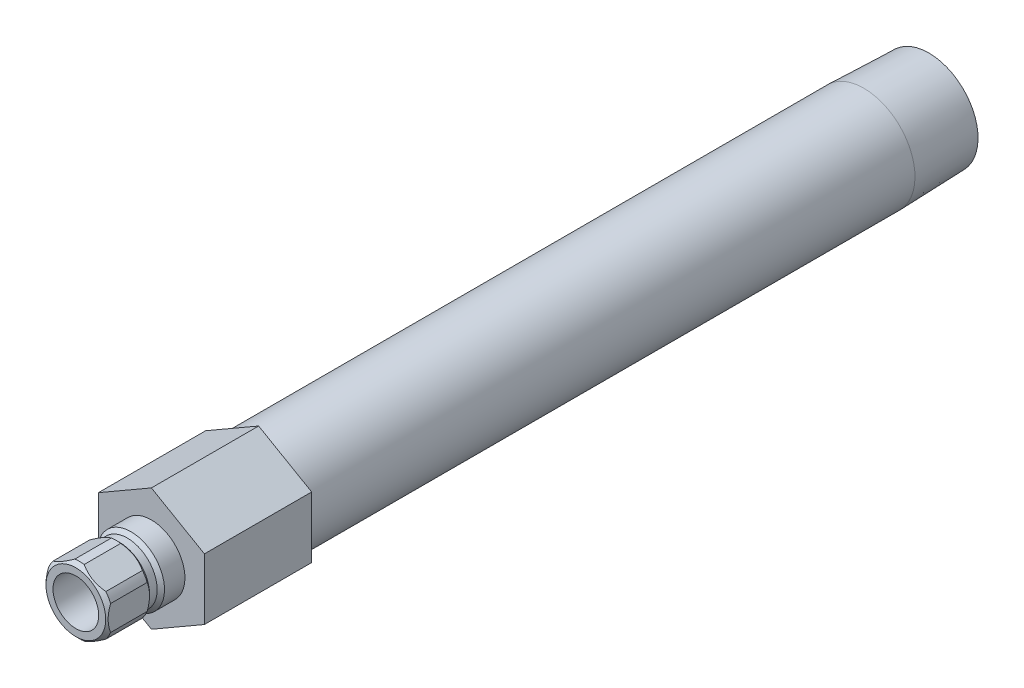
ISO-10303-21;
HEADER;
FILE_DESCRIPTION(('STEP AP214'),'2;1');
FILE_NAME('part.step','',(''),(''),'','','');
FILE_SCHEMA(('AUTOMOTIVE_DESIGN { 1 0 10303 214 1 1 1 1 }'));
ENDSEC;
DATA;
#1=APPLICATION_CONTEXT('core data for automotive mechanical design processes');
#2=APPLICATION_PROTOCOL_DEFINITION('international standard','automotive_design',2000,#1);
#3=PRODUCT_CONTEXT('',#1,'mechanical');
#4=PRODUCT('Part','Part','',(#3));
#5=PRODUCT_RELATED_PRODUCT_CATEGORY('part','',(#4));
#6=PRODUCT_DEFINITION_FORMATION('','',#4);
#7=PRODUCT_DEFINITION_CONTEXT('part definition',#1,'design');
#8=PRODUCT_DEFINITION('design','',#6,#7);
#9=PRODUCT_DEFINITION_SHAPE('','',#8);
#10=(LENGTH_UNIT() NAMED_UNIT(*) SI_UNIT(.MILLI.,.METRE.));
#11=(NAMED_UNIT(*) PLANE_ANGLE_UNIT() SI_UNIT($,.RADIAN.));
#12=(NAMED_UNIT(*) SI_UNIT($,.STERADIAN.) SOLID_ANGLE_UNIT());
#13=UNCERTAINTY_MEASURE_WITH_UNIT(LENGTH_MEASURE(1.E-05),#10,'distance_accuracy_value','');
#14=(GEOMETRIC_REPRESENTATION_CONTEXT(3) GLOBAL_UNCERTAINTY_ASSIGNED_CONTEXT((#13)) GLOBAL_UNIT_ASSIGNED_CONTEXT((#10,
#11,#12)) REPRESENTATION_CONTEXT('',''));
#15=CARTESIAN_POINT('',(0.,0.,0.));
#16=DIRECTION('',(0.,0.,1.));
#17=DIRECTION('',(1.,0.,0.));
#18=AXIS2_PLACEMENT_3D('',#15,#16,#17);
#19=CARTESIAN_POINT('',(0.,0.,13.1223734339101));
#20=DIRECTION('',(0.,0.,-1.));
#21=DIRECTION('',(0.,1.,0.));
#22=AXIS2_PLACEMENT_3D('',#19,#20,#21);
#23=CYLINDRICAL_SURFACE('',#22,6.985);
#24=DIRECTION('',(0.,0.,-1.));
#25=VECTOR('',#24,1.);
#26=CARTESIAN_POINT('',(5.50323442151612,-4.30170151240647,13.1223734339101));
#27=LINE('',#26,#25);
#28=CARTESIAN_POINT('',(5.50323442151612,-4.30170151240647,7.366));
#29=VERTEX_POINT('',#28);
#30=CARTESIAN_POINT('',(5.50323442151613,-4.30170151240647,14.986));
#31=VERTEX_POINT('',#30);
#32=EDGE_CURVE('E406',#29,#31,#27,.F.);
#33=ORIENTED_EDGE('',*,*,#32,.F.);
#34=CARTESIAN_POINT('',(0.,0.,7.366));
#35=DIRECTION('',(0.,0.,-1.));
#36=DIRECTION('',(0.,1.,0.));
#37=AXIS2_PLACEMENT_3D('',#34,#35,#36);
#38=CIRCLE('',#37,6.985);
#39=CARTESIAN_POINT('',(6.477,-2.61509005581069,7.366));
#40=VERTEX_POINT('',#39);
#41=EDGE_CURVE('E383',#40,#29,#38,.T.);
#42=ORIENTED_EDGE('',*,*,#41,.F.);
#43=DIRECTION('',(0.,0.,-1.));
#44=VECTOR('',#43,1.);
#45=CARTESIAN_POINT('',(6.477,-2.61509005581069,13.1223734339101));
#46=LINE('',#45,#44);
#47=CARTESIAN_POINT('',(6.477,-2.6150900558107,14.986));
#48=VERTEX_POINT('',#47);
#49=EDGE_CURVE('E397',#48,#40,#46,.T.);
#50=ORIENTED_EDGE('',*,*,#49,.F.);
#51=CARTESIAN_POINT('',(0.,0.,14.986));
#52=DIRECTION('',(0.,0.,-1.));
#53=DIRECTION('',(0.,1.,0.));
#54=AXIS2_PLACEMENT_3D('',#51,#52,#53);
#55=CIRCLE('',#54,6.985);
#56=EDGE_CURVE('E191',#48,#31,#55,.T.);
#57=ORIENTED_EDGE('',*,*,#56,.T.);
#58=EDGE_LOOP('',(#33,#42,#50,#57));
#59=FACE_BOUND('',#58,.T.);
#60=ADVANCED_FACE('F34',(#59),#23,.T.);
#61=DIRECTION('',(0.,0.,-1.));
#62=VECTOR('',#61,1.);
#63=CARTESIAN_POINT('',(6.477,2.6150900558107,13.1223734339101));
#64=LINE('',#63,#62);
#65=CARTESIAN_POINT('',(6.477,2.6150900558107,7.366));
#66=VERTEX_POINT('',#65);
#67=CARTESIAN_POINT('',(6.477,2.6150900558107,14.986));
#68=VERTEX_POINT('',#67);
#69=EDGE_CURVE('E309',#66,#68,#64,.F.);
#70=ORIENTED_EDGE('',*,*,#69,.F.);
#71=CARTESIAN_POINT('',(5.50323442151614,4.30170151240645,7.366));
#72=VERTEX_POINT('',#71);
#73=EDGE_CURVE('E204',#72,#66,#38,.T.);
#74=ORIENTED_EDGE('',*,*,#73,.F.);
#75=DIRECTION('',(0.,0.,-1.));
#76=VECTOR('',#75,1.);
#77=CARTESIAN_POINT('',(5.50323442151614,4.30170151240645,13.1223734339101));
#78=LINE('',#77,#76);
#79=CARTESIAN_POINT('',(5.50323442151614,4.30170151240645,14.986));
#80=VERTEX_POINT('',#79);
#81=EDGE_CURVE('E394',#80,#72,#78,.T.);
#82=ORIENTED_EDGE('',*,*,#81,.F.);
#83=EDGE_CURVE('E198',#80,#68,#55,.T.);
#84=ORIENTED_EDGE('',*,*,#83,.T.);
#85=EDGE_LOOP('',(#70,#74,#82,#84));
#86=FACE_BOUND('',#85,.T.);
#87=ADVANCED_FACE('F343',(#86),#23,.T.);
#88=DIRECTION('',(0.,0.,-1.));
#89=VECTOR('',#88,1.);
#90=CARTESIAN_POINT('',(0.973765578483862,6.91679156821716,13.1223734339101));
#91=LINE('',#90,#89);
#92=CARTESIAN_POINT('',(0.973765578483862,6.91679156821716,7.366));
#93=VERTEX_POINT('',#92);
#94=CARTESIAN_POINT('',(0.973765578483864,6.91679156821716,14.986));
#95=VERTEX_POINT('',#94);
#96=EDGE_CURVE('E399',#93,#95,#91,.F.);
#97=ORIENTED_EDGE('',*,*,#96,.F.);
#98=CARTESIAN_POINT('',(-0.973765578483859,6.91679156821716,7.366));
#99=VERTEX_POINT('',#98);
#100=EDGE_CURVE('E200',#99,#93,#38,.T.);
#101=ORIENTED_EDGE('',*,*,#100,.F.);
#102=DIRECTION('',(0.,0.,-1.));
#103=VECTOR('',#102,1.);
#104=CARTESIAN_POINT('',(-0.973765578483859,6.91679156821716,13.1223734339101));
#105=LINE('',#104,#103);
#106=CARTESIAN_POINT('',(-0.973765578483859,6.91679156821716,14.986));
#107=VERTEX_POINT('',#106);
#108=EDGE_CURVE('E375',#107,#99,#105,.T.);
#109=ORIENTED_EDGE('',*,*,#108,.F.);
#110=EDGE_CURVE('E193',#107,#95,#55,.T.);
#111=ORIENTED_EDGE('',*,*,#110,.T.);
#112=EDGE_LOOP('',(#97,#101,#109,#111));
#113=FACE_BOUND('',#112,.T.);
#114=ADVANCED_FACE('F348',(#113),#23,.T.);
#115=DIRECTION('',(0.,0.,-1.));
#116=VECTOR('',#115,1.);
#117=CARTESIAN_POINT('',(-5.50323442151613,4.30170151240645,13.1223734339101));
#118=LINE('',#117,#116);
#119=CARTESIAN_POINT('',(-5.50323442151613,4.30170151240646,7.366));
#120=VERTEX_POINT('',#119);
#121=CARTESIAN_POINT('',(-5.50323442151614,4.30170151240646,14.986));
#122=VERTEX_POINT('',#121);
#123=EDGE_CURVE('E54',#120,#122,#118,.F.);
#124=ORIENTED_EDGE('',*,*,#123,.F.);
#125=CARTESIAN_POINT('',(-6.477,2.6150900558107,7.366));
#126=VERTEX_POINT('',#125);
#127=EDGE_CURVE('E203',#126,#120,#38,.T.);
#128=ORIENTED_EDGE('',*,*,#127,.F.);
#129=DIRECTION('',(0.,0.,-1.));
#130=VECTOR('',#129,1.);
#131=CARTESIAN_POINT('',(-6.477,2.6150900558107,13.1223734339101));
#132=LINE('',#131,#130);
#133=CARTESIAN_POINT('',(-6.477,2.61509005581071,14.986));
#134=VERTEX_POINT('',#133);
#135=EDGE_CURVE('E263',#134,#126,#132,.T.);
#136=ORIENTED_EDGE('',*,*,#135,.F.);
#137=EDGE_CURVE('E189',#134,#122,#55,.T.);
#138=ORIENTED_EDGE('',*,*,#137,.T.);
#139=EDGE_LOOP('',(#124,#128,#136,#138));
#140=FACE_BOUND('',#139,.T.);
#141=ADVANCED_FACE('F360',(#140),#23,.T.);
#142=DIRECTION('',(0.,0.,-1.));
#143=VECTOR('',#142,1.);
#144=CARTESIAN_POINT('',(-6.477,-2.6150900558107,13.1223734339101));
#145=LINE('',#144,#143);
#146=CARTESIAN_POINT('',(-6.477,-2.61509005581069,7.366));
#147=VERTEX_POINT('',#146);
#148=CARTESIAN_POINT('',(-6.477,-2.6150900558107,14.986));
#149=VERTEX_POINT('',#148);
#150=EDGE_CURVE('E62',#147,#149,#145,.F.);
#151=ORIENTED_EDGE('',*,*,#150,.F.);
#152=CARTESIAN_POINT('',(-5.50323442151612,-4.30170151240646,7.366));
#153=VERTEX_POINT('',#152);
#154=EDGE_CURVE('E182',#153,#147,#38,.T.);
#155=ORIENTED_EDGE('',*,*,#154,.F.);
#156=DIRECTION('',(0.,0.,-1.));
#157=VECTOR('',#156,1.);
#158=CARTESIAN_POINT('',(-5.50323442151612,-4.30170151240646,13.1223734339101));
#159=LINE('',#158,#157);
#160=CARTESIAN_POINT('',(-5.50323442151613,-4.30170151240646,14.986));
#161=VERTEX_POINT('',#160);
#162=EDGE_CURVE('E165',#161,#153,#159,.T.);
#163=ORIENTED_EDGE('',*,*,#162,.F.);
#164=EDGE_CURVE('E180',#161,#149,#55,.T.);
#165=ORIENTED_EDGE('',*,*,#164,.T.);
#166=EDGE_LOOP('',(#151,#155,#163,#165));
#167=FACE_BOUND('',#166,.T.);
#168=ADVANCED_FACE('F179',(#167),#23,.T.);
#169=CARTESIAN_POINT('',(0.,0.,13.1223734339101));
#170=DIRECTION('',(0.,0.,-1.));
#171=DIRECTION('',(0.,1.,0.));
#172=AXIS2_PLACEMENT_3D('',#169,#170,#171);
#173=CYLINDRICAL_SURFACE('',#172,10.668);
#174=CARTESIAN_POINT('',(0.,0.,-148.4884));
#175=DIRECTION('',(0.,0.,-1.));
#176=DIRECTION('',(0.,1.,0.));
#177=AXIS2_PLACEMENT_3D('',#174,#175,#176);
#178=CIRCLE('',#177,10.6679999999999);
#179=CARTESIAN_POINT('',(0.,10.668,-148.4884));
#180=VERTEX_POINT('',#179);
#181=EDGE_CURVE('E217',#180,#180,#178,.T.);
#182=ORIENTED_EDGE('',*,*,#181,.F.);
#183=EDGE_LOOP('',(#182));
#184=FACE_BOUND('',#183,.T.);
#185=CARTESIAN_POINT('',(0.,0.,-22.352));
#186=DIRECTION('',(0.,0.,1.));
#187=DIRECTION('',(1.,0.,0.));
#188=AXIS2_PLACEMENT_3D('',#185,#186,#187);
#189=CIRCLE('',#188,10.668);
#190=CARTESIAN_POINT('',(10.668,0.,-22.352));
#191=VERTEX_POINT('',#190);
#192=EDGE_CURVE('E231',#191,#191,#189,.F.);
#193=ORIENTED_EDGE('',*,*,#192,.T.);
#194=EDGE_LOOP('',(#193));
#195=FACE_BOUND('',#194,.T.);
#196=ADVANCED_FACE('F359',(#184,#195),#173,.T.);
#197=CARTESIAN_POINT('',(0.,0.,13.1223734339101));
#198=DIRECTION('',(0.,0.,-1.));
#199=DIRECTION('',(0.,1.,0.));
#200=AXIS2_PLACEMENT_3D('',#197,#198,#199);
#201=CYLINDRICAL_SURFACE('',#200,4.76249999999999);
#202=CARTESIAN_POINT('',(0.,0.,15.748));
#203=DIRECTION('',(0.,0.,-1.));
#204=DIRECTION('',(0.,1.,0.));
#205=AXIS2_PLACEMENT_3D('',#202,#203,#204);
#206=CIRCLE('',#205,4.7625);
#207=CARTESIAN_POINT('',(0.,4.7625,15.748));
#208=VERTEX_POINT('',#207);
#209=EDGE_CURVE('E233',#208,#208,#206,.T.);
#210=ORIENTED_EDGE('',*,*,#209,.F.);
#211=EDGE_LOOP('',(#210));
#212=FACE_BOUND('',#211,.T.);
#213=CARTESIAN_POINT('',(0.,0.,-22.352));
#214=DIRECTION('',(0.,0.,-1.));
#215=DIRECTION('',(0.,1.,0.));
#216=AXIS2_PLACEMENT_3D('',#213,#214,#215);
#217=CIRCLE('',#216,4.76249999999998);
#218=CARTESIAN_POINT('',(0.,4.7625,-22.352));
#219=VERTEX_POINT('',#218);
#220=EDGE_CURVE('E174',#219,#219,#217,.T.);
#221=ORIENTED_EDGE('',*,*,#220,.T.);
#222=EDGE_LOOP('',(#221));
#223=FACE_BOUND('',#222,.T.);
#224=ADVANCED_FACE('F36',(#212,#223),#201,.F.);
#225=CARTESIAN_POINT('',(0.,4.7625,-22.352));
#226=DIRECTION('',(0.,0.,-1.));
#227=DIRECTION('',(0.,1.,0.));
#228=AXIS2_PLACEMENT_3D('',#225,#226,#227);
#229=PLANE('',#228);
#230=CARTESIAN_POINT('',(0.,0.,-22.352));
#231=DIRECTION('',(0.,0.,-1.));
#232=DIRECTION('',(0.,1.,0.));
#233=AXIS2_PLACEMENT_3D('',#230,#231,#232);
#234=CIRCLE('',#233,7.89939999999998);
#235=CARTESIAN_POINT('',(0.,7.8994,-22.352));
#236=VERTEX_POINT('',#235);
#237=EDGE_CURVE('E226',#236,#236,#234,.T.);
#238=ORIENTED_EDGE('',*,*,#237,.T.);
#239=EDGE_LOOP('',(#238));
#240=FACE_BOUND('',#239,.T.);
#241=ORIENTED_EDGE('',*,*,#220,.F.);
#242=EDGE_LOOP('',(#241));
#243=FACE_BOUND('',#242,.T.);
#244=ADVANCED_FACE('F533',(#240,#243),#229,.T.);
#245=CARTESIAN_POINT('',(0.,0.,13.1223734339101));
#246=DIRECTION('',(0.,0.,-1.));
#247=DIRECTION('',(0.,1.,0.));
#248=AXIS2_PLACEMENT_3D('',#245,#246,#247);
#249=CYLINDRICAL_SURFACE('',#248,7.89939999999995);
#250=CARTESIAN_POINT('',(0.,0.,-162.052));
#251=DIRECTION('',(0.,0.,-1.));
#252=DIRECTION('',(0.,1.,0.));
#253=AXIS2_PLACEMENT_3D('',#250,#251,#252);
#254=CIRCLE('',#253,7.89939999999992);
#255=CARTESIAN_POINT('',(0.,7.8994,-162.052));
#256=VERTEX_POINT('',#255);
#257=EDGE_CURVE('E223',#256,#256,#254,.T.);
#258=ORIENTED_EDGE('',*,*,#257,.T.);
#259=EDGE_LOOP('',(#258));
#260=FACE_BOUND('',#259,.T.);
#261=ORIENTED_EDGE('',*,*,#237,.F.);
#262=EDGE_LOOP('',(#261));
#263=FACE_BOUND('',#262,.T.);
#264=ADVANCED_FACE('F530',(#260,#263),#249,.F.);
#265=CARTESIAN_POINT('',(0.,10.244140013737,-162.052));
#266=DIRECTION('',(0.,0.,-1.));
#267=DIRECTION('',(0.,1.,0.));
#268=AXIS2_PLACEMENT_3D('',#265,#266,#267);
#269=PLANE('',#268);
#270=CARTESIAN_POINT('',(0.,0.,-162.052));
#271=DIRECTION('',(0.,0.,-1.));
#272=DIRECTION('',(0.,1.,0.));
#273=AXIS2_PLACEMENT_3D('',#270,#271,#272);
#274=CIRCLE('',#273,10.2441400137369);
#275=CARTESIAN_POINT('',(0.,10.244140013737,-162.052));
#276=VERTEX_POINT('',#275);
#277=EDGE_CURVE('E220',#276,#276,#274,.T.);
#278=ORIENTED_EDGE('',*,*,#277,.T.);
#279=EDGE_LOOP('',(#278));
#280=FACE_BOUND('',#279,.T.);
#281=ORIENTED_EDGE('',*,*,#257,.F.);
#282=EDGE_LOOP('',(#281));
#283=FACE_BOUND('',#282,.T.);
#284=ADVANCED_FACE('F524',(#280,#283),#269,.T.);
#285=CARTESIAN_POINT('',(0.,0.,-162.052));
#286=DIRECTION('',(0.,0.,1.));
#287=DIRECTION('',(0.,-1.,0.));
#288=AXIS2_PLACEMENT_3D('',#285,#286,#287);
#289=CONICAL_SURFACE('',#288,10.2441400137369,0.0312396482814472);
#290=ORIENTED_EDGE('',*,*,#181,.T.);
#291=EDGE_LOOP('',(#290));
#292=FACE_BOUND('',#291,.T.);
#293=ORIENTED_EDGE('',*,*,#277,.F.);
#294=EDGE_LOOP('',(#293));
#295=FACE_BOUND('',#294,.T.);
#296=ADVANCED_FACE('F514',(#292,#295),#289,.T.);
#297=CARTESIAN_POINT('',(0.,6.985,0.));
#298=DIRECTION('',(0.,0.,1.));
#299=DIRECTION('',(0.,-1.,0.));
#300=AXIS2_PLACEMENT_3D('',#297,#298,#299);
#301=PLANE('',#300);
#302=CARTESIAN_POINT('',(0.,0.,0.));
#303=DIRECTION('',(0.,0.,-1.));
#304=DIRECTION('',(0.,1.,0.));
#305=AXIS2_PLACEMENT_3D('',#302,#303,#304);
#306=CIRCLE('',#305,6.98499999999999);
#307=CARTESIAN_POINT('',(0.,6.985,0.));
#308=VERTEX_POINT('',#307);
#309=EDGE_CURVE('E214',#308,#308,#306,.T.);
#310=ORIENTED_EDGE('',*,*,#309,.T.);
#311=EDGE_LOOP('',(#310));
#312=FACE_BOUND('',#311,.T.);
#313=DIRECTION('',(-0.866025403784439,-0.5,0.));
#314=VECTOR('',#313,1.);
#315=CARTESIAN_POINT('',(0.,12.7582862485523,0.));
#316=LINE('',#315,#314);
#317=CARTESIAN_POINT('',(0.,12.7582862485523,0.));
#318=VERTEX_POINT('',#317);
#319=CARTESIAN_POINT('',(-11.049,6.37914312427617,0.));
#320=VERTEX_POINT('',#319);
#321=EDGE_CURVE('E409',#318,#320,#316,.T.);
#322=ORIENTED_EDGE('',*,*,#321,.T.);
#323=DIRECTION('',(0.,-1.,0.));
#324=VECTOR('',#323,1.);
#325=CARTESIAN_POINT('',(-11.049,6.37914312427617,0.));
#326=LINE('',#325,#324);
#327=CARTESIAN_POINT('',(-11.049,-6.37914312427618,0.));
#328=VERTEX_POINT('',#327);
#329=EDGE_CURVE('E436',#320,#328,#326,.T.);
#330=ORIENTED_EDGE('',*,*,#329,.T.);
#331=DIRECTION('',(0.866025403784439,-0.5,0.));
#332=VECTOR('',#331,1.);
#333=CARTESIAN_POINT('',(-11.049,-6.37914312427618,0.));
#334=LINE('',#333,#332);
#335=CARTESIAN_POINT('',(0.,-12.7582862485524,0.));
#336=VERTEX_POINT('',#335);
#337=EDGE_CURVE('E439',#328,#336,#334,.T.);
#338=ORIENTED_EDGE('',*,*,#337,.T.);
#339=DIRECTION('',(0.866025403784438,0.5,0.));
#340=VECTOR('',#339,1.);
#341=CARTESIAN_POINT('',(0.,-12.7582862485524,0.));
#342=LINE('',#341,#340);
#343=CARTESIAN_POINT('',(11.049,-6.37914312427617,0.));
#344=VERTEX_POINT('',#343);
#345=EDGE_CURVE('E442',#336,#344,#342,.T.);
#346=ORIENTED_EDGE('',*,*,#345,.T.);
#347=DIRECTION('',(0.,1.,0.));
#348=VECTOR('',#347,1.);
#349=CARTESIAN_POINT('',(11.049,-6.37914312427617,0.));
#350=LINE('',#349,#348);
#351=CARTESIAN_POINT('',(11.049,6.37914312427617,0.));
#352=VERTEX_POINT('',#351);
#353=EDGE_CURVE('E445',#344,#352,#350,.T.);
#354=ORIENTED_EDGE('',*,*,#353,.T.);
#355=DIRECTION('',(-0.866025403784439,0.5,0.));
#356=VECTOR('',#355,1.);
#357=CARTESIAN_POINT('',(11.049,6.37914312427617,0.));
#358=LINE('',#357,#356);
#359=EDGE_CURVE('E418',#352,#318,#358,.T.);
#360=ORIENTED_EDGE('',*,*,#359,.T.);
#361=EDGE_LOOP('',(#322,#330,#338,#346,#354,#360));
#362=FACE_BOUND('',#361,.T.);
#363=ADVANCED_FACE('F511',(#312,#362),#301,.T.);
#364=CARTESIAN_POINT('',(0.,0.,13.1223734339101));
#365=DIRECTION('',(0.,0.,-1.));
#366=DIRECTION('',(0.,1.,0.));
#367=AXIS2_PLACEMENT_3D('',#364,#365,#366);
#368=CYLINDRICAL_SURFACE('',#367,6.98499999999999);
#369=CARTESIAN_POINT('',(0.,0.,4.25449999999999));
#370=DIRECTION('',(0.,0.,-1.));
#371=DIRECTION('',(0.,1.,0.));
#372=AXIS2_PLACEMENT_3D('',#369,#370,#371);
#373=CIRCLE('',#372,6.98499999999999);
#374=CARTESIAN_POINT('',(0.,6.985,4.2545));
#375=VERTEX_POINT('',#374);
#376=EDGE_CURVE('E211',#375,#375,#373,.T.);
#377=ORIENTED_EDGE('',*,*,#376,.T.);
#378=EDGE_LOOP('',(#377));
#379=FACE_BOUND('',#378,.T.);
#380=ORIENTED_EDGE('',*,*,#309,.F.);
#381=EDGE_LOOP('',(#380));
#382=FACE_BOUND('',#381,.T.);
#383=ADVANCED_FACE('F513',(#379,#382),#368,.T.);
#384=CARTESIAN_POINT('',(0.,0.,4.25449999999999));
#385=DIRECTION('',(0.,0.,-1.));
#386=DIRECTION('',(0.,1.,0.));
#387=AXIS2_PLACEMENT_3D('',#384,#385,#386);
#388=CONICAL_SURFACE('',#387,6.98499999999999,0.785398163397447);
#389=CARTESIAN_POINT('',(0.,0.,5.0165));
#390=DIRECTION('',(0.,0.,-1.));
#391=DIRECTION('',(0.,1.,0.));
#392=AXIS2_PLACEMENT_3D('',#389,#390,#391);
#393=CIRCLE('',#392,6.223);
#394=CARTESIAN_POINT('',(0.,6.223,5.0165));
#395=VERTEX_POINT('',#394);
#396=EDGE_CURVE('E208',#395,#395,#393,.T.);
#397=ORIENTED_EDGE('',*,*,#396,.T.);
#398=EDGE_LOOP('',(#397));
#399=FACE_BOUND('',#398,.T.);
#400=ORIENTED_EDGE('',*,*,#376,.F.);
#401=EDGE_LOOP('',(#400));
#402=FACE_BOUND('',#401,.T.);
#403=ADVANCED_FACE('F521',(#399,#402),#388,.T.);
#404=CARTESIAN_POINT('',(0.,0.,13.1223734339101));
#405=DIRECTION('',(0.,0.,-1.));
#406=DIRECTION('',(0.,1.,0.));
#407=AXIS2_PLACEMENT_3D('',#404,#405,#406);
#408=CYLINDRICAL_SURFACE('',#407,6.223);
#409=CARTESIAN_POINT('',(0.,0.,6.604));
#410=DIRECTION('',(0.,0.,-1.));
#411=DIRECTION('',(0.,1.,0.));
#412=AXIS2_PLACEMENT_3D('',#409,#410,#411);
#413=CIRCLE('',#412,6.223);
#414=CARTESIAN_POINT('',(0.,6.223,6.604));
#415=VERTEX_POINT('',#414);
#416=EDGE_CURVE('E205',#415,#415,#413,.T.);
#417=ORIENTED_EDGE('',*,*,#416,.T.);
#418=EDGE_LOOP('',(#417));
#419=FACE_BOUND('',#418,.T.);
#420=ORIENTED_EDGE('',*,*,#396,.F.);
#421=EDGE_LOOP('',(#420));
#422=FACE_BOUND('',#421,.T.);
#423=ADVANCED_FACE('F270',(#419,#422),#408,.T.);
#424=CARTESIAN_POINT('',(0.,0.,6.604));
#425=DIRECTION('',(0.,0.,1.));
#426=DIRECTION('',(0.,-1.,0.));
#427=AXIS2_PLACEMENT_3D('',#424,#425,#426);
#428=CONICAL_SURFACE('',#427,6.223,0.785398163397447);
#429=CARTESIAN_POINT('',(0.97330298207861,-6.91705864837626,7.3662));
#430=CARTESIAN_POINT('',(1.15430521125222,-6.81255696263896,7.28788330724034));
#431=CARTESIAN_POINT('',(1.33782092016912,-6.70660411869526,7.21664558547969));
#432=CARTESIAN_POINT('',(1.70963160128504,-6.49193912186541,7.09114753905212));
#433=CARTESIAN_POINT('',(1.89793754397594,-6.38322063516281,7.03693086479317));
#434=CARTESIAN_POINT('',(2.27146153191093,-6.16756646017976,6.95027563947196));
#435=CARTESIAN_POINT('',(2.45655498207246,-6.06070270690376,6.91713772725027));
#436=CARTESIAN_POINT('',(2.82844640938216,-5.8459910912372,6.87178043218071));
#437=CARTESIAN_POINT('',(3.01524193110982,-5.73814464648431,6.85953461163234));
#438=CARTESIAN_POINT('',(3.39480578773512,-5.51900335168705,6.85669437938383));
#439=CARTESIAN_POINT('',(3.58757842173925,-5.40770601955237,6.86678827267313));
#440=CARTESIAN_POINT('',(3.97148128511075,-5.18605959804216,6.9093291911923));
#441=CARTESIAN_POINT('',(4.16260891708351,-5.07571200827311,6.9418066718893));
#442=CARTESIAN_POINT('',(4.54854122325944,-4.85289388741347,7.02857263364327));
#443=CARTESIAN_POINT('',(4.74321398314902,-4.74049951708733,7.08363522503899));
#444=CARTESIAN_POINT('',(5.03141021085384,-4.57410934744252,7.17999209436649));
#445=CARTESIAN_POINT('',(5.12673323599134,-4.51907457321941,7.21435772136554));
#446=CARTESIAN_POINT('',(5.31613879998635,-4.40972121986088,7.28725547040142));
#447=CARTESIAN_POINT('',(5.41022179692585,-4.3554023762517,7.32578600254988));
#448=CARTESIAN_POINT('',(5.50369701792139,-4.30143443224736,7.3662));
#449=B_SPLINE_CURVE_WITH_KNOTS('',3,(#429,#430,#431,#432,#433,#434,#435,#436,#437,#438,#439,
#440,#441,#442,#443,#444,#445,#446,#447,#448),.UNSPECIFIED.,.F.,.F.,(4,2,2,2,2,2,2,2,2,4),(0.,
0.669810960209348,1.34132587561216,1.9892054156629,2.63626449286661,3.30353665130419,
3.97171850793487,4.66502165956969,5.01088265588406,5.35661208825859),.UNSPECIFIED.);
#450=CARTESIAN_POINT('',(0.973765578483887,-6.91679156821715,7.366));
#451=VERTEX_POINT('',#450);
#452=EDGE_CURVE('E408',#451,#29,#449,.T.);
#453=ORIENTED_EDGE('',*,*,#452,.F.);
#454=CARTESIAN_POINT('',(-0.97376557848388,-6.91679156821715,7.366));
#455=VERTEX_POINT('',#454);
#456=EDGE_CURVE('E381',#451,#455,#38,.T.);
#457=ORIENTED_EDGE('',*,*,#456,.T.);
#458=CARTESIAN_POINT('',(-5.50369701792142,-4.30143443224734,7.36620000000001));
#459=CARTESIAN_POINT('',(-5.32269478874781,-4.40593611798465,7.28788330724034));
#460=CARTESIAN_POINT('',(-5.13917907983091,-4.51188896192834,7.2166455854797));
#461=CARTESIAN_POINT('',(-4.76736839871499,-4.7265539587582,7.09114753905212));
#462=CARTESIAN_POINT('',(-4.57906245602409,-4.83527244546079,7.03693086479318));
#463=CARTESIAN_POINT('',(-4.20553846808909,-5.05092662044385,6.95027563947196));
#464=CARTESIAN_POINT('',(-4.02044501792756,-5.15779037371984,6.91713772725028));
#465=CARTESIAN_POINT('',(-3.64855359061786,-5.37250198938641,6.87178043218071));
#466=CARTESIAN_POINT('',(-3.4617580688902,-5.48034843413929,6.85953461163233));
#467=CARTESIAN_POINT('',(-3.0821942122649,-5.69948972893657,6.85669437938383));
#468=CARTESIAN_POINT('',(-2.88942157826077,-5.81078706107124,6.86678827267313));
#469=CARTESIAN_POINT('',(-2.50551871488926,-6.03243348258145,6.90932919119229));
#470=CARTESIAN_POINT('',(-2.3143910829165,-6.1427810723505,6.9418066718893));
#471=CARTESIAN_POINT('',(-1.92845877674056,-6.36559919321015,7.02857263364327));
#472=CARTESIAN_POINT('',(-1.73378601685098,-6.47799356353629,7.08363522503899));
#473=CARTESIAN_POINT('',(-1.44558978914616,-6.6443837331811,7.17999209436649));
#474=CARTESIAN_POINT('',(-1.35026676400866,-6.69941850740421,7.21435772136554));
#475=CARTESIAN_POINT('',(-1.16086120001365,-6.80877186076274,7.28725547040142));
#476=CARTESIAN_POINT('',(-1.06677820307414,-6.86309070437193,7.32578600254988));
#477=CARTESIAN_POINT('',(-0.973302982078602,-6.91705864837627,7.3662));
#478=B_SPLINE_CURVE_WITH_KNOTS('',3,(#458,#459,#460,#461,#462,#463,#464,#465,#466,#467,#468,
#469,#470,#471,#472,#473,#474,#475,#476,#477),.UNSPECIFIED.,.F.,.F.,(4,2,2,2,2,2,2,2,2,4),(0.,
0.669810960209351,1.34132587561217,1.98920541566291,2.63626449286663,3.30353665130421,
3.97171850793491,4.66502165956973,5.0108826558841,5.35661208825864),.UNSPECIFIED.);
#479=EDGE_CURVE('E256',#153,#455,#478,.T.);
#480=ORIENTED_EDGE('',*,*,#479,.F.);
#481=ORIENTED_EDGE('',*,*,#154,.T.);
#482=CARTESIAN_POINT('',(-6.477,-7.50531717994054,10.2946933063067));
#483=CARTESIAN_POINT('',(-6.477,-7.32278230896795,10.1565337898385));
#484=CARTESIAN_POINT('',(-6.477,-7.13923073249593,10.0196957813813));
#485=CARTESIAN_POINT('',(-6.477,-6.76969107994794,9.74925615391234));
#486=CARTESIAN_POINT('',(-6.477,-6.58370240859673,9.61565534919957));
#487=CARTESIAN_POINT('',(-6.477,-6.20752484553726,9.35133325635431));
#488=CARTESIAN_POINT('',(-6.477,-6.01731457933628,9.22064228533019));
#489=CARTESIAN_POINT('',(-6.477,-5.63367369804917,8.96409124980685));
#490=CARTESIAN_POINT('',(-6.477,-5.44024331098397,8.83823084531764));
#491=CARTESIAN_POINT('',(-6.477,-5.03831720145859,8.58528971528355));
#492=CARTESIAN_POINT('',(-6.477,-4.8295984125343,8.45856164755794));
#493=CARTESIAN_POINT('',(-6.477,-4.4072839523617,8.21337587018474));
#494=CARTESIAN_POINT('',(-6.477,-4.19368750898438,8.09491948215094));
#495=CARTESIAN_POINT('',(-6.477,-3.7616267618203,7.8688284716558));
#496=CARTESIAN_POINT('',(-6.477,-3.54317924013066,7.76116202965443));
#497=CARTESIAN_POINT('',(-6.477,-3.100295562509,7.55906153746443));
#498=CARTESIAN_POINT('',(-6.477,-2.87586219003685,7.46462146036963));
#499=CARTESIAN_POINT('',(-6.477,-2.43955826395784,7.2995033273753));
#500=CARTESIAN_POINT('',(-6.477,-2.22819339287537,7.2275028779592));
#501=CARTESIAN_POINT('',(-6.477,-1.80033354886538,7.10045249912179));
#502=CARTESIAN_POINT('',(-6.477,-1.58383822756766,7.0454037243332));
#503=CARTESIAN_POINT('',(-6.477,-1.15063390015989,6.95606140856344));
#504=CARTESIAN_POINT('',(-6.477,-0.934000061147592,6.92140936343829));
#505=CARTESIAN_POINT('',(-6.477,-0.498364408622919,6.87354056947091));
#506=CARTESIAN_POINT('',(-6.477,-0.279363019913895,6.86032003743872));
#507=CARTESIAN_POINT('',(-6.477,0.150697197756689,6.85631642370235));
#508=CARTESIAN_POINT('',(-6.477,0.361748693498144,6.8647176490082));
#509=CARTESIAN_POINT('',(-6.477,0.782066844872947,6.90168275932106));
#510=CARTESIAN_POINT('',(-6.477,0.991333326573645,6.93024858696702));
#511=CARTESIAN_POINT('',(-6.477,1.41010575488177,7.00646246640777));
#512=CARTESIAN_POINT('',(-6.477,1.61955133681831,7.05443689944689));
#513=CARTESIAN_POINT('',(-6.477,2.03387291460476,7.16689535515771));
#514=CARTESIAN_POINT('',(-6.477,2.23874927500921,7.2313780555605));
#515=CARTESIAN_POINT('',(-6.477,2.66141718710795,7.38044013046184));
#516=CARTESIAN_POINT('',(-6.477,2.87875617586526,7.46628961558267));
#517=CARTESIAN_POINT('',(-6.477,3.30779766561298,7.65118196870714));
#518=CARTESIAN_POINT('',(-6.477,3.51949749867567,7.75023095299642));
#519=CARTESIAN_POINT('',(-6.477,3.93828980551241,7.95916705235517));
#520=CARTESIAN_POINT('',(-6.477,4.14536521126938,8.06908810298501));
#521=CARTESIAN_POINT('',(-6.477,4.5547539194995,8.2973403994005));
#522=CARTESIAN_POINT('',(-6.477,4.75706796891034,8.41567031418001));
#523=CARTESIAN_POINT('',(-6.477,5.1476137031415,8.65303908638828));
#524=CARTESIAN_POINT('',(-6.477,5.33604552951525,8.77175038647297));
#525=CARTESIAN_POINT('',(-6.477,5.70967381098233,9.01417488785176));
#526=CARTESIAN_POINT('',(-6.477,5.89487001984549,9.13788846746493));
#527=CARTESIAN_POINT('',(-6.477,6.26095063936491,9.38840412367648));
#528=CARTESIAN_POINT('',(-6.477,6.44185783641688,9.51517302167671));
#529=CARTESIAN_POINT('',(-6.477,6.80119835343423,9.77207065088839));
#530=CARTESIAN_POINT('',(-6.477,6.97963234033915,9.90219844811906));
#531=CARTESIAN_POINT('',(-6.477,7.1570303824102,10.0336997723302));
#532=B_SPLINE_CURVE_WITH_KNOTS('',3,(#482,#483,#484,#485,#486,#487,#488,#489,#490,#491,#492,
#493,#494,#495,#496,#497,#498,#499,#500,#501,#502,#503,#504,#505,#506,#507,#508,#509,#510,#511,
#512,#513,#514,#515,#516,#517,#518,#519,#520,#521,#522,#523,#524,#525,#526,#527,#528,#529,#530,
#531),.UNSPECIFIED.,.F.,.F.,(4,2,2,2,2,2,2,2,2,2,2,2,2,2,2,2,2,2,2,2,2,2,2,2,4),(0.,
0.686790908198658,1.37375281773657,2.06603541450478,2.75826919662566,3.49065471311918,
4.22315698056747,4.95343127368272,5.68337170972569,6.35265989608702,7.02199365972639,
7.67918147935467,8.33625327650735,8.96890298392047,9.60161364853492,10.2454384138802,
10.8892116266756,11.5897073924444,12.2905288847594,12.9936114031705,13.6965828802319,
14.3646145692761,15.0326968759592,15.6953618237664,16.3578444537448),.UNSPECIFIED.);
#533=EDGE_CURVE('E279',#126,#147,#532,.F.);
#534=ORIENTED_EDGE('',*,*,#533,.F.);
#535=ORIENTED_EDGE('',*,*,#127,.T.);
#536=CARTESIAN_POINT('',(-0.97330298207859,6.91705864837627,7.3662));
#537=CARTESIAN_POINT('',(-1.1543052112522,6.81255696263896,7.28788330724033));
#538=CARTESIAN_POINT('',(-1.3378209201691,6.70660411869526,7.21664558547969));
#539=CARTESIAN_POINT('',(-1.70963160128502,6.49193912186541,7.09114753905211));
#540=CARTESIAN_POINT('',(-1.89793754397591,6.38322063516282,7.03693086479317));
#541=CARTESIAN_POINT('',(-2.27146153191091,6.16756646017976,6.95027563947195));
#542=CARTESIAN_POINT('',(-2.45655498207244,6.06070270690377,6.91713772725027));
#543=CARTESIAN_POINT('',(-2.82844640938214,5.8459910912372,6.87178043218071));
#544=CARTESIAN_POINT('',(-3.0152419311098,5.73814464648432,6.85953461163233));
#545=CARTESIAN_POINT('',(-3.3948057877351,5.51900335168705,6.85669437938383));
#546=CARTESIAN_POINT('',(-3.58757842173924,5.40770601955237,6.86678827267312));
#547=CARTESIAN_POINT('',(-3.97148128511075,5.18605959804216,6.90932919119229));
#548=CARTESIAN_POINT('',(-4.16260891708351,5.07571200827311,6.94180667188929));
#549=CARTESIAN_POINT('',(-4.54854122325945,4.85289388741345,7.02857263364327));
#550=CARTESIAN_POINT('',(-4.74321398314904,4.74049951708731,7.08363522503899));
#551=CARTESIAN_POINT('',(-5.03141021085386,4.5741093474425,7.17999209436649));
#552=CARTESIAN_POINT('',(-5.12673323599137,4.51907457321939,7.21435772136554));
#553=CARTESIAN_POINT('',(-5.31613879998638,4.40972121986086,7.28725547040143));
#554=CARTESIAN_POINT('',(-5.41022179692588,4.35540237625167,7.32578600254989));
#555=CARTESIAN_POINT('',(-5.50369701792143,4.30143443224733,7.36620000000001));
#556=B_SPLINE_CURVE_WITH_KNOTS('',3,(#536,#537,#538,#539,#540,#541,#542,#543,#544,#545,#546,
#547,#548,#549,#550,#551,#552,#553,#554,#555),.UNSPECIFIED.,.F.,.F.,(4,2,2,2,2,2,2,2,2,4),(0.,
0.669810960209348,1.34132587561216,1.9892054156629,2.63626449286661,3.3035366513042,
3.97171850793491,4.66502165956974,5.01088265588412,5.35661208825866),.UNSPECIFIED.);
#557=EDGE_CURVE('E286',#99,#120,#556,.T.);
#558=ORIENTED_EDGE('',*,*,#557,.F.);
#559=ORIENTED_EDGE('',*,*,#100,.T.);
#560=CARTESIAN_POINT('',(5.5036970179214,4.30143443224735,7.3662));
#561=CARTESIAN_POINT('',(5.32269478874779,4.40593611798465,7.28788330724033));
#562=CARTESIAN_POINT('',(5.13917907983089,4.51188896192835,7.21664558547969));
#563=CARTESIAN_POINT('',(4.76736839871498,4.7265539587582,7.09114753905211));
#564=CARTESIAN_POINT('',(4.57906245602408,4.8352724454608,7.03693086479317));
#565=CARTESIAN_POINT('',(4.20553846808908,5.05092662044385,6.95027563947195));
#566=CARTESIAN_POINT('',(4.02044501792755,5.15779037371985,6.91713772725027));
#567=CARTESIAN_POINT('',(3.64855359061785,5.37250198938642,6.87178043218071));
#568=CARTESIAN_POINT('',(3.46175806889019,5.4803484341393,6.85953461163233));
#569=CARTESIAN_POINT('',(3.08219421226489,5.69948972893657,6.85669437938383));
#570=CARTESIAN_POINT('',(2.88942157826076,5.81078706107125,6.86678827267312));
#571=CARTESIAN_POINT('',(2.50551871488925,6.03243348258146,6.90932919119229));
#572=CARTESIAN_POINT('',(2.31439108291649,6.1427810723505,6.94180667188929));
#573=CARTESIAN_POINT('',(1.92845877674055,6.36559919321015,7.02857263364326));
#574=CARTESIAN_POINT('',(1.73378601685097,6.47799356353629,7.08363522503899));
#575=CARTESIAN_POINT('',(1.44558978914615,6.64438373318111,7.17999209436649));
#576=CARTESIAN_POINT('',(1.35026676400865,6.69941850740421,7.21435772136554));
#577=CARTESIAN_POINT('',(1.16086120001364,6.80877186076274,7.28725547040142));
#578=CARTESIAN_POINT('',(1.06677820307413,6.86309070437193,7.32578600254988));
#579=CARTESIAN_POINT('',(0.973302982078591,6.91705864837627,7.3662));
#580=B_SPLINE_CURVE_WITH_KNOTS('',3,(#560,#561,#562,#563,#564,#565,#566,#567,#568,#569,#570,
#571,#572,#573,#574,#575,#576,#577,#578,#579),.UNSPECIFIED.,.F.,.F.,(4,2,2,2,2,2,2,2,2,4),(0.,
0.669810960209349,1.34132587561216,1.9892054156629,2.63626449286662,3.3035366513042,
3.9717185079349,4.66502165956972,5.0108826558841,5.35661208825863),.UNSPECIFIED.);
#581=EDGE_CURVE('E293',#72,#93,#580,.T.);
#582=ORIENTED_EDGE('',*,*,#581,.F.);
#583=ORIENTED_EDGE('',*,*,#73,.T.);
#584=CARTESIAN_POINT('',(6.477,-7.50531717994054,10.2946933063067));
#585=CARTESIAN_POINT('',(6.477,-7.32278230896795,10.1565337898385));
#586=CARTESIAN_POINT('',(6.477,-7.13923073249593,10.0196957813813));
#587=CARTESIAN_POINT('',(6.477,-6.76969107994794,9.74925615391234));
#588=CARTESIAN_POINT('',(6.477,-6.58370240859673,9.61565534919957));
#589=CARTESIAN_POINT('',(6.477,-6.20752484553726,9.35133325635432));
#590=CARTESIAN_POINT('',(6.477,-6.01731457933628,9.22064228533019));
#591=CARTESIAN_POINT('',(6.477,-5.63367369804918,8.96409124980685));
#592=CARTESIAN_POINT('',(6.477,-5.44024331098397,8.83823084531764));
#593=CARTESIAN_POINT('',(6.477,-5.03831720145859,8.58528971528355));
#594=CARTESIAN_POINT('',(6.477,-4.82959841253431,8.45856164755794));
#595=CARTESIAN_POINT('',(6.477,-4.4072839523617,8.21337587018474));
#596=CARTESIAN_POINT('',(6.477,-4.19368750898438,8.09491948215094));
#597=CARTESIAN_POINT('',(6.477,-3.76162676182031,7.8688284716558));
#598=CARTESIAN_POINT('',(6.477,-3.54317924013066,7.76116202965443));
#599=CARTESIAN_POINT('',(6.477,-3.100295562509,7.55906153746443));
#600=CARTESIAN_POINT('',(6.477,-2.87586219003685,7.46462146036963));
#601=CARTESIAN_POINT('',(6.477,-2.43955826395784,7.2995033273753));
#602=CARTESIAN_POINT('',(6.477,-2.22819339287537,7.2275028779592));
#603=CARTESIAN_POINT('',(6.477,-1.80033354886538,7.10045249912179));
#604=CARTESIAN_POINT('',(6.477,-1.58383822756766,7.0454037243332));
#605=CARTESIAN_POINT('',(6.477,-1.15063390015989,6.95606140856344));
#606=CARTESIAN_POINT('',(6.477,-0.934000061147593,6.92140936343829));
#607=CARTESIAN_POINT('',(6.477,-0.498364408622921,6.87354056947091));
#608=CARTESIAN_POINT('',(6.477,-0.279363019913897,6.86032003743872));
#609=CARTESIAN_POINT('',(6.477,0.150697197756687,6.85631642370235));
#610=CARTESIAN_POINT('',(6.477,0.361748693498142,6.8647176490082));
#611=CARTESIAN_POINT('',(6.477,0.782066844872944,6.90168275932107));
#612=CARTESIAN_POINT('',(6.477,0.991333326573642,6.93024858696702));
#613=CARTESIAN_POINT('',(6.477,1.41010575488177,7.00646246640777));
#614=CARTESIAN_POINT('',(6.477,1.6195513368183,7.05443689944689));
#615=CARTESIAN_POINT('',(6.477,2.03387291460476,7.16689535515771));
#616=CARTESIAN_POINT('',(6.477,2.23874927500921,7.2313780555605));
#617=CARTESIAN_POINT('',(6.477,2.66141718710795,7.38044013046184));
#618=CARTESIAN_POINT('',(6.477,2.87875617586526,7.46628961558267));
#619=CARTESIAN_POINT('',(6.477,3.30779766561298,7.65118196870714));
#620=CARTESIAN_POINT('',(6.477,3.51949749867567,7.75023095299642));
#621=CARTESIAN_POINT('',(6.477,3.93828980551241,7.95916705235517));
#622=CARTESIAN_POINT('',(6.477,4.14536521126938,8.06908810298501));
#623=CARTESIAN_POINT('',(6.477,4.5547539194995,8.2973403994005));
#624=CARTESIAN_POINT('',(6.477,4.75706796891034,8.41567031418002));
#625=CARTESIAN_POINT('',(6.477,5.1476137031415,8.65303908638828));
#626=CARTESIAN_POINT('',(6.477,5.33604552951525,8.77175038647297));
#627=CARTESIAN_POINT('',(6.477,5.70967381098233,9.01417488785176));
#628=CARTESIAN_POINT('',(6.477,5.8948700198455,9.13788846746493));
#629=CARTESIAN_POINT('',(6.477,6.26095063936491,9.38840412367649));
#630=CARTESIAN_POINT('',(6.477,6.44185783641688,9.51517302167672));
#631=CARTESIAN_POINT('',(6.477,6.80119835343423,9.77207065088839));
#632=CARTESIAN_POINT('',(6.477,6.97963234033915,9.90219844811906));
#633=CARTESIAN_POINT('',(6.477,7.1570303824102,10.0336997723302));
#634=B_SPLINE_CURVE_WITH_KNOTS('',3,(#584,#585,#586,#587,#588,#589,#590,#591,#592,#593,#594,
#595,#596,#597,#598,#599,#600,#601,#602,#603,#604,#605,#606,#607,#608,#609,#610,#611,#612,#613,
#614,#615,#616,#617,#618,#619,#620,#621,#622,#623,#624,#625,#626,#627,#628,#629,#630,#631,#632,
#633),.UNSPECIFIED.,.F.,.F.,(4,2,2,2,2,2,2,2,2,2,2,2,2,2,2,2,2,2,2,2,2,2,2,2,4),(0.,
0.68679090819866,1.37375281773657,2.06603541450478,2.75826919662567,3.49065471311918,
4.22315698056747,4.95343127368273,5.6833717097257,6.35265989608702,7.02199365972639,
7.67918147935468,8.33625327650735,8.96890298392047,9.60161364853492,10.2454384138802,
10.8892116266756,11.5897073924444,12.2905288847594,12.9936114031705,13.696582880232,
14.3646145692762,15.0326968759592,15.6953618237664,16.3578444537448),.UNSPECIFIED.);
#635=EDGE_CURVE('E301',#40,#66,#634,.T.);
#636=ORIENTED_EDGE('',*,*,#635,.F.);
#637=ORIENTED_EDGE('',*,*,#41,.T.);
#638=EDGE_LOOP('',(#453,#457,#480,#481,#534,#535,#558,#559,#582,#583,#636,#637));
#639=FACE_BOUND('',#638,.T.);
#640=ORIENTED_EDGE('',*,*,#416,.F.);
#641=EDGE_LOOP('',(#640));
#642=FACE_BOUND('',#641,.T.);
#643=ADVANCED_FACE('F265',(#639,#642),#428,.T.);
#644=DIRECTION('',(0.,0.,-1.));
#645=VECTOR('',#644,1.);
#646=CARTESIAN_POINT('',(0.973765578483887,-6.91679156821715,13.1223734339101));
#647=LINE('',#646,#645);
#648=CARTESIAN_POINT('',(0.973765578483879,-6.91679156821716,14.986));
#649=VERTEX_POINT('',#648);
#650=EDGE_CURVE('E308',#649,#451,#647,.T.);
#651=ORIENTED_EDGE('',*,*,#650,.F.);
#652=CARTESIAN_POINT('',(-0.973765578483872,-6.91679156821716,14.986));
#653=VERTEX_POINT('',#652);
#654=EDGE_CURVE('E188',#649,#653,#55,.T.);
#655=ORIENTED_EDGE('',*,*,#654,.T.);
#656=DIRECTION('',(0.,0.,-1.));
#657=VECTOR('',#656,1.);
#658=CARTESIAN_POINT('',(-0.97376557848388,-6.91679156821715,13.1223734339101));
#659=LINE('',#658,#657);
#660=EDGE_CURVE('E168',#455,#653,#659,.F.);
#661=ORIENTED_EDGE('',*,*,#660,.F.);
#662=ORIENTED_EDGE('',*,*,#456,.F.);
#663=EDGE_LOOP('',(#651,#655,#661,#662));
#664=FACE_BOUND('',#663,.T.);
#665=ADVANCED_FACE('F269',(#664),#23,.T.);
#666=CARTESIAN_POINT('',(0.,0.,14.986));
#667=DIRECTION('',(0.,0.,-1.));
#668=DIRECTION('',(0.,1.,0.));
#669=AXIS2_PLACEMENT_3D('',#666,#667,#668);
#670=CONICAL_SURFACE('',#669,6.985,0.785398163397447);
#671=CARTESIAN_POINT('',(5.50369701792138,-4.30143443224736,14.9858));
#672=CARTESIAN_POINT('',(5.32269478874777,-4.40593611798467,15.0641166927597));
#673=CARTESIAN_POINT('',(5.13917907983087,-4.51188896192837,15.1353544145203));
#674=CARTESIAN_POINT('',(4.76736839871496,-4.72655395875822,15.2608524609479));
#675=CARTESIAN_POINT('',(4.57906245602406,-4.83527244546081,15.3150691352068));
#676=CARTESIAN_POINT('',(4.20553846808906,-5.05092662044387,15.401724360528));
#677=CARTESIAN_POINT('',(4.02044501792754,-5.15779037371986,15.4348622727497));
#678=CARTESIAN_POINT('',(3.64855359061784,-5.37250198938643,15.4802195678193));
#679=CARTESIAN_POINT('',(3.46175806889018,-5.48034843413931,15.4924653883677));
#680=CARTESIAN_POINT('',(3.08219421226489,-5.69948972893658,15.4953056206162));
#681=CARTESIAN_POINT('',(2.88942157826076,-5.81078706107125,15.4852117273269));
#682=CARTESIAN_POINT('',(2.50551871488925,-6.03243348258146,15.4426708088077));
#683=CARTESIAN_POINT('',(2.3143910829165,-6.14278107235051,15.4101933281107));
#684=CARTESIAN_POINT('',(1.92845877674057,-6.36559919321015,15.3234273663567));
#685=CARTESIAN_POINT('',(1.73378601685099,-6.47799356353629,15.268364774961));
#686=CARTESIAN_POINT('',(1.44558978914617,-6.6443837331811,15.1720079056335));
#687=CARTESIAN_POINT('',(1.35026676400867,-6.6994185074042,15.1376422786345));
#688=CARTESIAN_POINT('',(1.16086120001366,-6.80877186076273,15.0647445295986));
#689=CARTESIAN_POINT('',(1.06677820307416,-6.86309070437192,15.0262139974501));
#690=CARTESIAN_POINT('',(0.973302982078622,-6.91705864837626,14.9858));
#691=B_SPLINE_CURVE_WITH_KNOTS('',3,(#671,#672,#673,#674,#675,#676,#677,#678,#679,#680,#681,
#682,#683,#684,#685,#686,#687,#688,#689,#690),.UNSPECIFIED.,.F.,.F.,(4,2,2,2,2,2,2,2,2,4),(0.,
0.669810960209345,1.34132587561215,1.98920541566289,2.6362644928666,3.30353665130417,
3.97171850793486,4.66502165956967,5.01088265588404,5.35661208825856),.UNSPECIFIED.);
#692=EDGE_CURVE('E12',#31,#649,#691,.T.);
#693=ORIENTED_EDGE('',*,*,#692,.F.);
#694=ORIENTED_EDGE('',*,*,#56,.F.);
#695=CARTESIAN_POINT('',(6.477,-7.50531717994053,12.0573066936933));
#696=CARTESIAN_POINT('',(6.477,-7.32278230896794,12.1954662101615));
#697=CARTESIAN_POINT('',(6.477,-7.13923073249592,12.3323042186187));
#698=CARTESIAN_POINT('',(6.477,-6.76969107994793,12.6027438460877));
#699=CARTESIAN_POINT('',(6.477,-6.58370240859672,12.7363446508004));
#700=CARTESIAN_POINT('',(6.477,-6.20752484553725,13.0006667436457));
#701=CARTESIAN_POINT('',(6.477,-6.01731457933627,13.1313577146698));
#702=CARTESIAN_POINT('',(6.477,-5.63367369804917,13.3879087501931));
#703=CARTESIAN_POINT('',(6.477,-5.44024331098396,13.5137691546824));
#704=CARTESIAN_POINT('',(6.477,-5.03831720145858,13.7667102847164));
#705=CARTESIAN_POINT('',(6.477,-4.8295984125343,13.893438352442));
#706=CARTESIAN_POINT('',(6.477,-4.4072839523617,14.1386241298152));
#707=CARTESIAN_POINT('',(6.477,-4.19368750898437,14.2570805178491));
#708=CARTESIAN_POINT('',(6.477,-3.7616267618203,14.4831715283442));
#709=CARTESIAN_POINT('',(6.477,-3.54317924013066,14.5908379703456));
#710=CARTESIAN_POINT('',(6.477,-3.100295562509,14.7929384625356));
#711=CARTESIAN_POINT('',(6.477,-2.87586219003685,14.8873785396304));
#712=CARTESIAN_POINT('',(6.477,-2.43955826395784,15.0524966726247));
#713=CARTESIAN_POINT('',(6.477,-2.22819339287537,15.1244971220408));
#714=CARTESIAN_POINT('',(6.477,-1.80033354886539,15.2515475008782));
#715=CARTESIAN_POINT('',(6.477,-1.58383822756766,15.3065962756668));
#716=CARTESIAN_POINT('',(6.477,-1.1506339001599,15.3959385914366));
#717=CARTESIAN_POINT('',(6.477,-0.934000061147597,15.4305906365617));
#718=CARTESIAN_POINT('',(6.477,-0.498364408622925,15.4784594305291));
#719=CARTESIAN_POINT('',(6.477,-0.279363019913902,15.4916799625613));
#720=CARTESIAN_POINT('',(6.477,0.150697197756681,15.4956835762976));
#721=CARTESIAN_POINT('',(6.477,0.361748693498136,15.4872823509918));
#722=CARTESIAN_POINT('',(6.477,0.782066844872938,15.4503172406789));
#723=CARTESIAN_POINT('',(6.477,0.991333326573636,15.421751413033));
#724=CARTESIAN_POINT('',(6.477,1.41010575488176,15.3455375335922));
#725=CARTESIAN_POINT('',(6.477,1.6195513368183,15.2975631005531));
#726=CARTESIAN_POINT('',(6.477,2.03387291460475,15.1851046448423));
#727=CARTESIAN_POINT('',(6.477,2.2387492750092,15.1206219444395));
#728=CARTESIAN_POINT('',(6.477,2.66141718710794,14.9715598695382));
#729=CARTESIAN_POINT('',(6.477,2.87875617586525,14.8857103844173));
#730=CARTESIAN_POINT('',(6.477,3.30779766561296,14.7008180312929));
#731=CARTESIAN_POINT('',(6.477,3.51949749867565,14.6017690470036));
#732=CARTESIAN_POINT('',(6.477,3.93828980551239,14.3928329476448));
#733=CARTESIAN_POINT('',(6.477,4.14536521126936,14.282911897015));
#734=CARTESIAN_POINT('',(6.477,4.55475391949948,14.0546596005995));
#735=CARTESIAN_POINT('',(6.477,4.75706796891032,13.93632968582));
#736=CARTESIAN_POINT('',(6.477,5.14761370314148,13.6989609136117));
#737=CARTESIAN_POINT('',(6.477,5.33604552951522,13.580249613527));
#738=CARTESIAN_POINT('',(6.477,5.70967381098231,13.3378251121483));
#739=CARTESIAN_POINT('',(6.477,5.89487001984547,13.2141115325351));
#740=CARTESIAN_POINT('',(6.477,6.26095063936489,12.9635958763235));
#741=CARTESIAN_POINT('',(6.477,6.44185783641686,12.8368269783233));
#742=CARTESIAN_POINT('',(6.477,6.80119835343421,12.5799293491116));
#743=CARTESIAN_POINT('',(6.477,6.97963234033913,12.449801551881));
#744=CARTESIAN_POINT('',(6.477,7.15703038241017,12.3183002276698));
#745=B_SPLINE_CURVE_WITH_KNOTS('',3,(#695,#696,#697,#698,#699,#700,#701,#702,#703,#704,#705,
#706,#707,#708,#709,#710,#711,#712,#713,#714,#715,#716,#717,#718,#719,#720,#721,#722,#723,#724,
#725,#726,#727,#728,#729,#730,#731,#732,#733,#734,#735,#736,#737,#738,#739,#740,#741,#742,#743,
#744),.UNSPECIFIED.,.F.,.F.,(4,2,2,2,2,2,2,2,2,2,2,2,2,2,2,2,2,2,2,2,2,2,2,2,4),(0.,
0.686790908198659,1.37375281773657,2.06603541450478,2.75826919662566,3.49065471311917,
4.22315698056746,4.95343127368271,5.68337170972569,6.35265989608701,7.02199365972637,
7.67918147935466,8.33625327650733,8.96890298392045,9.6016136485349,10.2454384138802,
10.8892116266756,11.5897073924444,12.2905288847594,12.9936114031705,13.6965828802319,
14.3646145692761,15.0326968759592,15.6953618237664,16.3578444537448),.UNSPECIFIED.);
#746=EDGE_CURVE('E47',#68,#48,#745,.F.);
#747=ORIENTED_EDGE('',*,*,#746,.F.);
#748=ORIENTED_EDGE('',*,*,#83,.F.);
#749=CARTESIAN_POINT('',(0.973302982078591,6.91705864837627,14.9858));
#750=CARTESIAN_POINT('',(1.15430521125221,6.81255696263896,15.0641166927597));
#751=CARTESIAN_POINT('',(1.33782092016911,6.70660411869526,15.1353544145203));
#752=CARTESIAN_POINT('',(1.70963160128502,6.49193912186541,15.2608524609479));
#753=CARTESIAN_POINT('',(1.89793754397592,6.38322063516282,15.3150691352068));
#754=CARTESIAN_POINT('',(2.27146153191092,6.16756646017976,15.401724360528));
#755=CARTESIAN_POINT('',(2.45655498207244,6.06070270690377,15.4348622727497));
#756=CARTESIAN_POINT('',(2.82844640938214,5.8459910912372,15.4802195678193));
#757=CARTESIAN_POINT('',(3.0152419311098,5.73814464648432,15.4924653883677));
#758=CARTESIAN_POINT('',(3.3948057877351,5.51900335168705,15.4953056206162));
#759=CARTESIAN_POINT('',(3.58757842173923,5.40770601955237,15.4852117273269));
#760=CARTESIAN_POINT('',(3.97148128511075,5.18605959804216,15.4426708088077));
#761=CARTESIAN_POINT('',(4.16260891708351,5.07571200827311,15.4101933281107));
#762=CARTESIAN_POINT('',(4.54854122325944,4.85289388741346,15.3234273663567));
#763=CARTESIAN_POINT('',(4.74321398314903,4.74049951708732,15.268364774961));
#764=CARTESIAN_POINT('',(5.03141021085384,4.57410934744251,15.1720079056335));
#765=CARTESIAN_POINT('',(5.12673323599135,4.5190745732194,15.1376422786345));
#766=CARTESIAN_POINT('',(5.31613879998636,4.40972121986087,15.0647445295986));
#767=CARTESIAN_POINT('',(5.41022179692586,4.35540237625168,15.0262139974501));
#768=CARTESIAN_POINT('',(5.5036970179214,4.30143443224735,14.9858));
#769=B_SPLINE_CURVE_WITH_KNOTS('',3,(#749,#750,#751,#752,#753,#754,#755,#756,#757,#758,#759,
#760,#761,#762,#763,#764,#765,#766,#767,#768),.UNSPECIFIED.,.F.,.F.,(4,2,2,2,2,2,2,2,2,4),(0.,
0.669810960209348,1.34132587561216,1.98920541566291,2.63626449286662,3.3035366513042,
3.9717185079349,4.66502165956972,5.01088265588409,5.35661208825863),.UNSPECIFIED.);
#770=EDGE_CURVE('E325',#95,#80,#769,.T.);
#771=ORIENTED_EDGE('',*,*,#770,.F.);
#772=ORIENTED_EDGE('',*,*,#110,.F.);
#773=CARTESIAN_POINT('',(-5.50369701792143,4.30143443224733,14.9858));
#774=CARTESIAN_POINT('',(-5.32269478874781,4.40593611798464,15.0641166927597));
#775=CARTESIAN_POINT('',(-5.13917907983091,4.51188896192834,15.1353544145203));
#776=CARTESIAN_POINT('',(-4.767368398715,4.72655395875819,15.2608524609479));
#777=CARTESIAN_POINT('',(-4.5790624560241,4.83527244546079,15.3150691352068));
#778=CARTESIAN_POINT('',(-4.20553846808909,5.05092662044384,15.401724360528));
#779=CARTESIAN_POINT('',(-4.02044501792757,5.15779037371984,15.4348622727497));
#780=CARTESIAN_POINT('',(-3.64855359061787,5.37250198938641,15.4802195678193));
#781=CARTESIAN_POINT('',(-3.46175806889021,5.48034843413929,15.4924653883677));
#782=CARTESIAN_POINT('',(-3.0821942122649,5.69948972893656,15.4953056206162));
#783=CARTESIAN_POINT('',(-2.88942157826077,5.81078706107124,15.4852117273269));
#784=CARTESIAN_POINT('',(-2.50551871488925,6.03243348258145,15.4426708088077));
#785=CARTESIAN_POINT('',(-2.31439108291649,6.1427810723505,15.4101933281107));
#786=CARTESIAN_POINT('',(-1.92845877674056,6.36559919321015,15.3234273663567));
#787=CARTESIAN_POINT('',(-1.73378601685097,6.47799356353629,15.268364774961));
#788=CARTESIAN_POINT('',(-1.44558978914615,6.6443837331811,15.1720079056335));
#789=CARTESIAN_POINT('',(-1.35026676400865,6.69941850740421,15.1376422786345));
#790=CARTESIAN_POINT('',(-1.16086120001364,6.80877186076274,15.0647445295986));
#791=CARTESIAN_POINT('',(-1.06677820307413,6.86309070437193,15.0262139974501));
#792=CARTESIAN_POINT('',(-0.973302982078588,6.91705864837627,14.9858));
#793=B_SPLINE_CURVE_WITH_KNOTS('',3,(#773,#774,#775,#776,#777,#778,#779,#780,#781,#782,#783,
#784,#785,#786,#787,#788,#789,#790,#791,#792),.UNSPECIFIED.,.F.,.F.,(4,2,2,2,2,2,2,2,2,4),(0.,
0.669810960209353,1.34132587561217,1.98920541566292,2.63626449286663,3.30353665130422,
3.97171850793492,4.66502165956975,5.01088265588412,5.35661208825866),.UNSPECIFIED.);
#794=EDGE_CURVE('E329',#122,#107,#793,.T.);
#795=ORIENTED_EDGE('',*,*,#794,.F.);
#796=ORIENTED_EDGE('',*,*,#137,.F.);
#797=CARTESIAN_POINT('',(-6.477,-7.50531717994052,12.0573066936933));
#798=CARTESIAN_POINT('',(-6.477,-7.32278230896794,12.1954662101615));
#799=CARTESIAN_POINT('',(-6.477,-7.13923073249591,12.3323042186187));
#800=CARTESIAN_POINT('',(-6.477,-6.76969107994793,12.6027438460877));
#801=CARTESIAN_POINT('',(-6.477,-6.58370240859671,12.7363446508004));
#802=CARTESIAN_POINT('',(-6.477,-6.20752484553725,13.0006667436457));
#803=CARTESIAN_POINT('',(-6.477,-6.01731457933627,13.1313577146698));
#804=CARTESIAN_POINT('',(-6.477,-5.63367369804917,13.3879087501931));
#805=CARTESIAN_POINT('',(-6.477,-5.44024331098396,13.5137691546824));
#806=CARTESIAN_POINT('',(-6.477,-5.03831720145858,13.7667102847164));
#807=CARTESIAN_POINT('',(-6.477,-4.8295984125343,13.893438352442));
#808=CARTESIAN_POINT('',(-6.477,-4.40728395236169,14.1386241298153));
#809=CARTESIAN_POINT('',(-6.477,-4.19368750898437,14.2570805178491));
#810=CARTESIAN_POINT('',(-6.477,-3.7616267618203,14.4831715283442));
#811=CARTESIAN_POINT('',(-6.477,-3.54317924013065,14.5908379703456));
#812=CARTESIAN_POINT('',(-6.477,-3.100295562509,14.7929384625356));
#813=CARTESIAN_POINT('',(-6.477,-2.87586219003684,14.8873785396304));
#814=CARTESIAN_POINT('',(-6.477,-2.43955826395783,15.0524966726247));
#815=CARTESIAN_POINT('',(-6.477,-2.22819339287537,15.1244971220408));
#816=CARTESIAN_POINT('',(-6.477,-1.80033354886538,15.2515475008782));
#817=CARTESIAN_POINT('',(-6.477,-1.58383822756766,15.3065962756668));
#818=CARTESIAN_POINT('',(-6.477,-1.15063390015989,15.3959385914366));
#819=CARTESIAN_POINT('',(-6.477,-0.934000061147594,15.4305906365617));
#820=CARTESIAN_POINT('',(-6.477,-0.498364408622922,15.4784594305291));
#821=CARTESIAN_POINT('',(-6.477,-0.279363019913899,15.4916799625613));
#822=CARTESIAN_POINT('',(-6.477,0.150697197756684,15.4956835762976));
#823=CARTESIAN_POINT('',(-6.477,0.36174869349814,15.4872823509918));
#824=CARTESIAN_POINT('',(-6.477,0.782066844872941,15.4503172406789));
#825=CARTESIAN_POINT('',(-6.477,0.991333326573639,15.421751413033));
#826=CARTESIAN_POINT('',(-6.477,1.41010575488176,15.3455375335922));
#827=CARTESIAN_POINT('',(-6.477,1.6195513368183,15.2975631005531));
#828=CARTESIAN_POINT('',(-6.477,2.03387291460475,15.1851046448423));
#829=CARTESIAN_POINT('',(-6.477,2.2387492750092,15.1206219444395));
#830=CARTESIAN_POINT('',(-6.477,2.66141718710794,14.9715598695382));
#831=CARTESIAN_POINT('',(-6.477,2.87875617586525,14.8857103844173));
#832=CARTESIAN_POINT('',(-6.477,3.30779766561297,14.7008180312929));
#833=CARTESIAN_POINT('',(-6.477,3.51949749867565,14.6017690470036));
#834=CARTESIAN_POINT('',(-6.477,3.9382898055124,14.3928329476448));
#835=CARTESIAN_POINT('',(-6.477,4.14536521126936,14.282911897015));
#836=CARTESIAN_POINT('',(-6.477,4.55475391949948,14.0546596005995));
#837=CARTESIAN_POINT('',(-6.477,4.75706796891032,13.93632968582));
#838=CARTESIAN_POINT('',(-6.477,5.14761370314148,13.6989609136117));
#839=CARTESIAN_POINT('',(-6.477,5.33604552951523,13.580249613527));
#840=CARTESIAN_POINT('',(-6.477,5.70967381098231,13.3378251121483));
#841=CARTESIAN_POINT('',(-6.477,5.89487001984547,13.2141115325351));
#842=CARTESIAN_POINT('',(-6.477,6.26095063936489,12.9635958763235));
#843=CARTESIAN_POINT('',(-6.477,6.44185783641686,12.8368269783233));
#844=CARTESIAN_POINT('',(-6.477,6.80119835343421,12.5799293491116));
#845=CARTESIAN_POINT('',(-6.477,6.97963234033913,12.449801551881));
#846=CARTESIAN_POINT('',(-6.477,7.15703038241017,12.3183002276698));
#847=B_SPLINE_CURVE_WITH_KNOTS('',3,(#797,#798,#799,#800,#801,#802,#803,#804,#805,#806,#807,
#808,#809,#810,#811,#812,#813,#814,#815,#816,#817,#818,#819,#820,#821,#822,#823,#824,#825,#826,
#827,#828,#829,#830,#831,#832,#833,#834,#835,#836,#837,#838,#839,#840,#841,#842,#843,#844,#845,
#846),.UNSPECIFIED.,.F.,.F.,(4,2,2,2,2,2,2,2,2,2,2,2,2,2,2,2,2,2,2,2,2,2,2,2,4),(0.,
0.686790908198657,1.37375281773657,2.06603541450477,2.75826919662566,3.49065471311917,
4.22315698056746,4.95343127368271,5.68337170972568,6.35265989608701,7.02199365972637,
7.67918147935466,8.33625327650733,8.96890298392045,9.6016136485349,10.2454384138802,
10.8892116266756,11.5897073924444,12.2905288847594,12.9936114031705,13.6965828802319,
14.3646145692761,15.0326968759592,15.6953618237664,16.3578444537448),.UNSPECIFIED.);
#848=EDGE_CURVE('E173',#149,#134,#847,.T.);
#849=ORIENTED_EDGE('',*,*,#848,.F.);
#850=ORIENTED_EDGE('',*,*,#164,.F.);
#851=CARTESIAN_POINT('',(-0.973302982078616,-6.91705864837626,14.9858));
#852=CARTESIAN_POINT('',(-1.15430521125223,-6.81255696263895,15.0641166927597));
#853=CARTESIAN_POINT('',(-1.33782092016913,-6.70660411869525,15.1353544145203));
#854=CARTESIAN_POINT('',(-1.70963160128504,-6.4919391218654,15.2608524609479));
#855=CARTESIAN_POINT('',(-1.89793754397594,-6.38322063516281,15.3150691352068));
#856=CARTESIAN_POINT('',(-2.27146153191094,-6.16756646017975,15.401724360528));
#857=CARTESIAN_POINT('',(-2.45655498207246,-6.06070270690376,15.4348622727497));
#858=CARTESIAN_POINT('',(-2.82844640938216,-5.84599109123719,15.4802195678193));
#859=CARTESIAN_POINT('',(-3.01524193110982,-5.73814464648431,15.4924653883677));
#860=CARTESIAN_POINT('',(-3.39480578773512,-5.51900335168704,15.4953056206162));
#861=CARTESIAN_POINT('',(-3.58757842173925,-5.40770601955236,15.4852117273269));
#862=CARTESIAN_POINT('',(-3.97148128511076,-5.18605959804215,15.4426708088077));
#863=CARTESIAN_POINT('',(-4.16260891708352,-5.07571200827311,15.4101933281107));
#864=CARTESIAN_POINT('',(-4.54854122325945,-4.85289388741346,15.3234273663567));
#865=CARTESIAN_POINT('',(-4.74321398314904,-4.74049951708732,15.268364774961));
#866=CARTESIAN_POINT('',(-5.03141021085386,-4.57410934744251,15.1720079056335));
#867=CARTESIAN_POINT('',(-5.12673323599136,-4.5190745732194,15.1376422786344));
#868=CARTESIAN_POINT('',(-5.31613879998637,-4.40972121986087,15.0647445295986));
#869=CARTESIAN_POINT('',(-5.41022179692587,-4.35540237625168,15.0262139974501));
#870=CARTESIAN_POINT('',(-5.50369701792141,-4.30143443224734,14.9858));
#871=B_SPLINE_CURVE_WITH_KNOTS('',3,(#851,#852,#853,#854,#855,#856,#857,#858,#859,#860,#861,
#862,#863,#864,#865,#866,#867,#868,#869,#870),.UNSPECIFIED.,.F.,.F.,(4,2,2,2,2,2,2,2,2,4),(0.,
0.669810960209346,1.34132587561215,1.9892054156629,2.6362644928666,3.30353665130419,
3.97171850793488,4.6650216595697,5.01088265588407,5.35661208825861),.UNSPECIFIED.);
#872=EDGE_CURVE('E162',#653,#161,#871,.T.);
#873=ORIENTED_EDGE('',*,*,#872,.F.);
#874=ORIENTED_EDGE('',*,*,#654,.F.);
#875=EDGE_LOOP('',(#693,#694,#747,#748,#771,#772,#795,#796,#849,#850,#873,#874));
#876=FACE_BOUND('',#875,.T.);
#877=CARTESIAN_POINT('',(0.,0.,15.748));
#878=DIRECTION('',(0.,0.,-1.));
#879=DIRECTION('',(0.,1.,0.));
#880=AXIS2_PLACEMENT_3D('',#877,#878,#879);
#881=CIRCLE('',#880,6.223);
#882=CARTESIAN_POINT('',(0.,6.223,15.748));
#883=VERTEX_POINT('',#882);
#884=EDGE_CURVE('E197',#883,#883,#881,.T.);
#885=ORIENTED_EDGE('',*,*,#884,.T.);
#886=EDGE_LOOP('',(#885));
#887=FACE_BOUND('',#886,.T.);
#888=ADVANCED_FACE('F185',(#876,#887),#670,.T.);
#889=CARTESIAN_POINT('',(0.,4.7625,15.748));
#890=DIRECTION('',(0.,0.,1.));
#891=DIRECTION('',(0.,-1.,0.));
#892=AXIS2_PLACEMENT_3D('',#889,#890,#891);
#893=PLANE('',#892);
#894=ORIENTED_EDGE('',*,*,#209,.T.);
#895=EDGE_LOOP('',(#894));
#896=FACE_BOUND('',#895,.T.);
#897=ORIENTED_EDGE('',*,*,#884,.F.);
#898=EDGE_LOOP('',(#897));
#899=FACE_BOUND('',#898,.T.);
#900=ADVANCED_FACE('F356',(#896,#899),#893,.T.);
#901=CARTESIAN_POINT('',(0.,12.7582862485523,-22.352));
#902=DIRECTION('',(-0.5,0.866025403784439,0.));
#903=DIRECTION('',(-0.866025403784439,-0.5,0.));
#904=AXIS2_PLACEMENT_3D('',#901,#902,#903);
#905=PLANE('',#904);
#906=ORIENTED_EDGE('',*,*,#321,.F.);
#907=DIRECTION('',(0.,0.,1.));
#908=VECTOR('',#907,1.);
#909=CARTESIAN_POINT('',(0.,12.7582862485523,-22.352));
#910=LINE('',#909,#908);
#911=CARTESIAN_POINT('',(0.,12.7582862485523,-22.352));
#912=VERTEX_POINT('',#911);
#913=EDGE_CURVE('E234',#912,#318,#910,.T.);
#914=ORIENTED_EDGE('',*,*,#913,.F.);
#915=DIRECTION('',(-0.866025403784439,-0.5,0.));
#916=VECTOR('',#915,1.);
#917=CARTESIAN_POINT('',(0.,12.7582862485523,-22.352));
#918=LINE('',#917,#916);
#919=CARTESIAN_POINT('',(-11.049,6.37914312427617,-22.352));
#920=VERTEX_POINT('',#919);
#921=EDGE_CURVE('E414',#912,#920,#918,.T.);
#922=ORIENTED_EDGE('',*,*,#921,.T.);
#923=DIRECTION('',(0.,0.,1.));
#924=VECTOR('',#923,1.);
#925=CARTESIAN_POINT('',(-11.049,6.37914312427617,-22.352));
#926=LINE('',#925,#924);
#927=EDGE_CURVE('E433',#920,#320,#926,.T.);
#928=ORIENTED_EDGE('',*,*,#927,.T.);
#929=EDGE_LOOP('',(#906,#914,#922,#928));
#930=FACE_BOUND('',#929,.T.);
#931=ADVANCED_FACE('F466',(#930),#905,.T.);
#932=CARTESIAN_POINT('',(11.049,6.37914312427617,-22.352));
#933=DIRECTION('',(0.5,0.866025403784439,0.));
#934=DIRECTION('',(-0.866025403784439,0.5,0.));
#935=AXIS2_PLACEMENT_3D('',#932,#933,#934);
#936=PLANE('',#935);
#937=ORIENTED_EDGE('',*,*,#359,.F.);
#938=DIRECTION('',(0.,0.,1.));
#939=VECTOR('',#938,1.);
#940=CARTESIAN_POINT('',(11.049,6.37914312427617,-22.352));
#941=LINE('',#940,#939);
#942=CARTESIAN_POINT('',(11.049,6.37914312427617,-22.352));
#943=VERTEX_POINT('',#942);
#944=EDGE_CURVE('E451',#943,#352,#941,.T.);
#945=ORIENTED_EDGE('',*,*,#944,.F.);
#946=DIRECTION('',(-0.866025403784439,0.5,0.));
#947=VECTOR('',#946,1.);
#948=CARTESIAN_POINT('',(11.049,6.37914312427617,-22.352));
#949=LINE('',#948,#947);
#950=EDGE_CURVE('E430',#943,#912,#949,.T.);
#951=ORIENTED_EDGE('',*,*,#950,.T.);
#952=ORIENTED_EDGE('',*,*,#913,.T.);
#953=EDGE_LOOP('',(#937,#945,#951,#952));
#954=FACE_BOUND('',#953,.T.);
#955=ADVANCED_FACE('F470',(#954),#936,.T.);
#956=CARTESIAN_POINT('',(11.049,-6.37914312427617,-22.352));
#957=DIRECTION('',(1.,0.,0.));
#958=DIRECTION('',(0.,0.,-1.));
#959=AXIS2_PLACEMENT_3D('',#956,#957,#958);
#960=PLANE('',#959);
#961=ORIENTED_EDGE('',*,*,#353,.F.);
#962=DIRECTION('',(0.,0.,1.));
#963=VECTOR('',#962,1.);
#964=CARTESIAN_POINT('',(11.049,-6.37914312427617,-22.352));
#965=LINE('',#964,#963);
#966=CARTESIAN_POINT('',(11.049,-6.37914312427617,-22.352));
#967=VERTEX_POINT('',#966);
#968=EDGE_CURVE('E453',#967,#344,#965,.T.);
#969=ORIENTED_EDGE('',*,*,#968,.F.);
#970=DIRECTION('',(0.,1.,0.));
#971=VECTOR('',#970,1.);
#972=CARTESIAN_POINT('',(11.049,-6.37914312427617,-22.352));
#973=LINE('',#972,#971);
#974=EDGE_CURVE('E427',#967,#943,#973,.T.);
#975=ORIENTED_EDGE('',*,*,#974,.T.);
#976=ORIENTED_EDGE('',*,*,#944,.T.);
#977=EDGE_LOOP('',(#961,#969,#975,#976));
#978=FACE_BOUND('',#977,.T.);
#979=ADVANCED_FACE('F485',(#978),#960,.T.);
#980=CARTESIAN_POINT('',(0.,-12.7582862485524,-22.352));
#981=DIRECTION('',(0.5,-0.866025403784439,0.));
#982=DIRECTION('',(0.866025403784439,0.5,0.));
#983=AXIS2_PLACEMENT_3D('',#980,#981,#982);
#984=PLANE('',#983);
#985=ORIENTED_EDGE('',*,*,#345,.F.);
#986=DIRECTION('',(0.,0.,1.));
#987=VECTOR('',#986,1.);
#988=CARTESIAN_POINT('',(0.,-12.7582862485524,-22.352));
#989=LINE('',#988,#987);
#990=CARTESIAN_POINT('',(0.,-12.7582862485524,-22.352));
#991=VERTEX_POINT('',#990);
#992=EDGE_CURVE('E455',#991,#336,#989,.T.);
#993=ORIENTED_EDGE('',*,*,#992,.F.);
#994=DIRECTION('',(0.866025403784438,0.5,0.));
#995=VECTOR('',#994,1.);
#996=CARTESIAN_POINT('',(0.,-12.7582862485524,-22.352));
#997=LINE('',#996,#995);
#998=EDGE_CURVE('E424',#991,#967,#997,.T.);
#999=ORIENTED_EDGE('',*,*,#998,.T.);
#1000=ORIENTED_EDGE('',*,*,#968,.T.);
#1001=EDGE_LOOP('',(#985,#993,#999,#1000));
#1002=FACE_BOUND('',#1001,.T.);
#1003=ADVANCED_FACE('F481',(#1002),#984,.T.);
#1004=CARTESIAN_POINT('',(-11.049,-6.37914312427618,-22.352));
#1005=DIRECTION('',(-0.5,-0.866025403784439,0.));
#1006=DIRECTION('',(0.866025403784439,-0.5,0.));
#1007=AXIS2_PLACEMENT_3D('',#1004,#1005,#1006);
#1008=PLANE('',#1007);
#1009=ORIENTED_EDGE('',*,*,#337,.F.);
#1010=DIRECTION('',(0.,0.,1.));
#1011=VECTOR('',#1010,1.);
#1012=CARTESIAN_POINT('',(-11.049,-6.37914312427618,-22.352));
#1013=LINE('',#1012,#1011);
#1014=CARTESIAN_POINT('',(-11.049,-6.37914312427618,-22.352));
#1015=VERTEX_POINT('',#1014);
#1016=EDGE_CURVE('E457',#1015,#328,#1013,.T.);
#1017=ORIENTED_EDGE('',*,*,#1016,.F.);
#1018=DIRECTION('',(0.866025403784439,-0.5,0.));
#1019=VECTOR('',#1018,1.);
#1020=CARTESIAN_POINT('',(-11.049,-6.37914312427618,-22.352));
#1021=LINE('',#1020,#1019);
#1022=EDGE_CURVE('E421',#1015,#991,#1021,.T.);
#1023=ORIENTED_EDGE('',*,*,#1022,.T.);
#1024=ORIENTED_EDGE('',*,*,#992,.T.);
#1025=EDGE_LOOP('',(#1009,#1017,#1023,#1024));
#1026=FACE_BOUND('',#1025,.T.);
#1027=ADVANCED_FACE('F477',(#1026),#1008,.T.);
#1028=CARTESIAN_POINT('',(-11.049,6.37914312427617,-22.352));
#1029=DIRECTION('',(-1.,0.,0.));
#1030=DIRECTION('',(0.,0.,1.));
#1031=AXIS2_PLACEMENT_3D('',#1028,#1029,#1030);
#1032=PLANE('',#1031);
#1033=ORIENTED_EDGE('',*,*,#329,.F.);
#1034=ORIENTED_EDGE('',*,*,#927,.F.);
#1035=DIRECTION('',(0.,-1.,0.));
#1036=VECTOR('',#1035,1.);
#1037=CARTESIAN_POINT('',(-11.049,6.37914312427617,-22.352));
#1038=LINE('',#1037,#1036);
#1039=EDGE_CURVE('E417',#920,#1015,#1038,.T.);
#1040=ORIENTED_EDGE('',*,*,#1039,.T.);
#1041=ORIENTED_EDGE('',*,*,#1016,.T.);
#1042=EDGE_LOOP('',(#1033,#1034,#1040,#1041));
#1043=FACE_BOUND('',#1042,.T.);
#1044=ADVANCED_FACE('F474',(#1043),#1032,.T.);
#1045=CARTESIAN_POINT('',(-11.049,6.37914312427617,-22.352));
#1046=DIRECTION('',(0.,0.,1.));
#1047=DIRECTION('',(1.,0.,0.));
#1048=AXIS2_PLACEMENT_3D('',#1045,#1046,#1047);
#1049=PLANE('',#1048);
#1050=ORIENTED_EDGE('',*,*,#192,.F.);
#1051=EDGE_LOOP('',(#1050));
#1052=FACE_BOUND('',#1051,.T.);
#1053=ORIENTED_EDGE('',*,*,#921,.F.);
#1054=ORIENTED_EDGE('',*,*,#950,.F.);
#1055=ORIENTED_EDGE('',*,*,#974,.F.);
#1056=ORIENTED_EDGE('',*,*,#998,.F.);
#1057=ORIENTED_EDGE('',*,*,#1022,.F.);
#1058=ORIENTED_EDGE('',*,*,#1039,.F.);
#1059=EDGE_LOOP('',(#1053,#1054,#1055,#1056,#1057,#1058));
#1060=FACE_BOUND('',#1059,.T.);
#1061=ADVANCED_FACE('F251',(#1052,#1060),#1049,.F.);
#1062=CARTESIAN_POINT('',(-6.477,-3.73949769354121,15.748));
#1063=DIRECTION('',(0.5,0.866025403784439,0.));
#1064=DIRECTION('',(-0.866025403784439,0.5,0.));
#1065=AXIS2_PLACEMENT_3D('',#1062,#1063,#1064);
#1066=PLANE('',#1065);
#1067=ORIENTED_EDGE('',*,*,#479,.T.);
#1068=ORIENTED_EDGE('',*,*,#660,.T.);
#1069=ORIENTED_EDGE('',*,*,#872,.T.);
#1070=ORIENTED_EDGE('',*,*,#162,.T.);
#1071=EDGE_LOOP('',(#1067,#1068,#1069,#1070));
#1072=FACE_BOUND('',#1071,.T.);
#1073=ADVANCED_FACE('F164',(#1072),#1066,.F.);
#1074=CARTESIAN_POINT('',(-6.477,3.73949769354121,15.748));
#1075=DIRECTION('',(1.,0.,0.));
#1076=DIRECTION('',(0.,1.,0.));
#1077=AXIS2_PLACEMENT_3D('',#1074,#1075,#1076);
#1078=PLANE('',#1077);
#1079=ORIENTED_EDGE('',*,*,#533,.T.);
#1080=ORIENTED_EDGE('',*,*,#150,.T.);
#1081=ORIENTED_EDGE('',*,*,#848,.T.);
#1082=ORIENTED_EDGE('',*,*,#135,.T.);
#1083=EDGE_LOOP('',(#1079,#1080,#1081,#1082));
#1084=FACE_BOUND('',#1083,.T.);
#1085=ADVANCED_FACE('F250',(#1084),#1078,.F.);
#1086=CARTESIAN_POINT('',(0.,7.47899538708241,15.748));
#1087=DIRECTION('',(0.5,-0.866025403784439,0.));
#1088=DIRECTION('',(0.866025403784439,0.5,0.));
#1089=AXIS2_PLACEMENT_3D('',#1086,#1087,#1088);
#1090=PLANE('',#1089);
#1091=ORIENTED_EDGE('',*,*,#557,.T.);
#1092=ORIENTED_EDGE('',*,*,#123,.T.);
#1093=ORIENTED_EDGE('',*,*,#794,.T.);
#1094=ORIENTED_EDGE('',*,*,#108,.T.);
#1095=EDGE_LOOP('',(#1091,#1092,#1093,#1094));
#1096=FACE_BOUND('',#1095,.T.);
#1097=ADVANCED_FACE('F333',(#1096),#1090,.F.);
#1098=CARTESIAN_POINT('',(6.477,3.7394976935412,15.748));
#1099=DIRECTION('',(-0.5,-0.866025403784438,0.));
#1100=DIRECTION('',(0.866025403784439,-0.5,0.));
#1101=AXIS2_PLACEMENT_3D('',#1098,#1099,#1100);
#1102=PLANE('',#1101);
#1103=ORIENTED_EDGE('',*,*,#581,.T.);
#1104=ORIENTED_EDGE('',*,*,#96,.T.);
#1105=ORIENTED_EDGE('',*,*,#770,.T.);
#1106=ORIENTED_EDGE('',*,*,#81,.T.);
#1107=EDGE_LOOP('',(#1103,#1104,#1105,#1106));
#1108=FACE_BOUND('',#1107,.T.);
#1109=ADVANCED_FACE('F315',(#1108),#1102,.F.);
#1110=CARTESIAN_POINT('',(6.477,-3.73949769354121,15.748));
#1111=DIRECTION('',(-1.,0.,0.));
#1112=DIRECTION('',(0.,0.,1.));
#1113=AXIS2_PLACEMENT_3D('',#1110,#1111,#1112);
#1114=PLANE('',#1113);
#1115=ORIENTED_EDGE('',*,*,#635,.T.);
#1116=ORIENTED_EDGE('',*,*,#69,.T.);
#1117=ORIENTED_EDGE('',*,*,#746,.T.);
#1118=ORIENTED_EDGE('',*,*,#49,.T.);
#1119=EDGE_LOOP('',(#1115,#1116,#1117,#1118));
#1120=FACE_BOUND('',#1119,.T.);
#1121=ADVANCED_FACE('F311',(#1120),#1114,.F.);
#1122=CARTESIAN_POINT('',(0.,-7.47899538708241,15.748));
#1123=DIRECTION('',(-0.5,0.866025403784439,0.));
#1124=DIRECTION('',(-0.866025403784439,-0.5,0.));
#1125=AXIS2_PLACEMENT_3D('',#1122,#1123,#1124);
#1126=PLANE('',#1125);
#1127=ORIENTED_EDGE('',*,*,#452,.T.);
#1128=ORIENTED_EDGE('',*,*,#32,.T.);
#1129=ORIENTED_EDGE('',*,*,#692,.T.);
#1130=ORIENTED_EDGE('',*,*,#650,.T.);
#1131=EDGE_LOOP('',(#1127,#1128,#1129,#1130));
#1132=FACE_BOUND('',#1131,.T.);
#1133=ADVANCED_FACE('F314',(#1132),#1126,.F.);
#1134=CLOSED_SHELL('',(#60,#87,#114,#141,#168,#196,#224,#244,#264,#284,#296,#363,#383,#403,#423,
#643,#665,#888,#900,#931,#955,#979,#1003,#1027,#1044,#1061,#1073,#1085,#1097,#1109,#1121,#1133));
#1135=MANIFOLD_SOLID_BREP('B2',#1134);
#1136=ADVANCED_BREP_SHAPE_REPRESENTATION('',(#18,#1135),#14);
#1137=SHAPE_DEFINITION_REPRESENTATION(#9,#1136);
ENDSEC;
END-ISO-10303-21;
